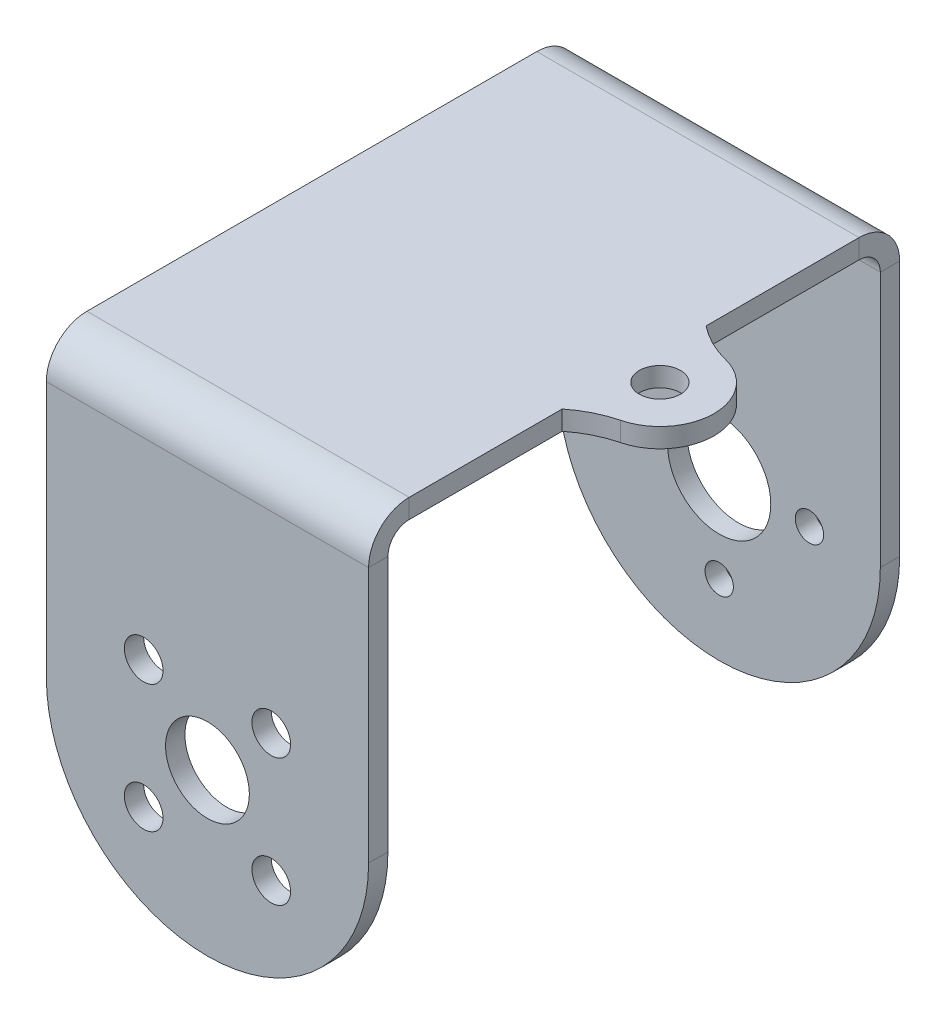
ISO-10303-21;
HEADER;
FILE_DESCRIPTION(('STEP AP214'),'2;1');
FILE_NAME('part.step','',(''),(''),'','','');
FILE_SCHEMA(('AUTOMOTIVE_DESIGN { 1 0 10303 214 1 1 1 1 }'));
ENDSEC;
DATA;
#1=APPLICATION_CONTEXT('core data for automotive mechanical design processes');
#2=APPLICATION_PROTOCOL_DEFINITION('international standard','automotive_design',2000,#1);
#3=PRODUCT_CONTEXT('',#1,'mechanical');
#4=PRODUCT('Part','Part','',(#3));
#5=PRODUCT_RELATED_PRODUCT_CATEGORY('part','',(#4));
#6=PRODUCT_DEFINITION_FORMATION('','',#4);
#7=PRODUCT_DEFINITION_CONTEXT('part definition',#1,'design');
#8=PRODUCT_DEFINITION('design','',#6,#7);
#9=PRODUCT_DEFINITION_SHAPE('','',#8);
#10=(LENGTH_UNIT() NAMED_UNIT(*) SI_UNIT(.MILLI.,.METRE.));
#11=(NAMED_UNIT(*) PLANE_ANGLE_UNIT() SI_UNIT($,.RADIAN.));
#12=(NAMED_UNIT(*) SI_UNIT($,.STERADIAN.) SOLID_ANGLE_UNIT());
#13=UNCERTAINTY_MEASURE_WITH_UNIT(LENGTH_MEASURE(1.E-05),#10,'distance_accuracy_value','');
#14=(GEOMETRIC_REPRESENTATION_CONTEXT(3) GLOBAL_UNCERTAINTY_ASSIGNED_CONTEXT((#13)) GLOBAL_UNIT_ASSIGNED_CONTEXT((#10,
#11,#12)) REPRESENTATION_CONTEXT('',''));
#15=CARTESIAN_POINT('',(0.,0.,0.));
#16=DIRECTION('',(0.,0.,1.));
#17=DIRECTION('',(1.,0.,0.));
#18=AXIS2_PLACEMENT_3D('',#15,#16,#17);
#19=CARTESIAN_POINT('',(12.5,-1.5,19.1));
#20=DIRECTION('',(1.,0.,0.));
#21=DIRECTION('',(0.,0.,-1.));
#22=AXIS2_PLACEMENT_3D('',#19,#20,#21);
#23=PLANE('',#22);
#24=DIRECTION('',(0.,-1.,0.));
#25=VECTOR('',#24,1.);
#26=CARTESIAN_POINT('',(12.5,0.,-5.58170194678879));
#27=LINE('',#26,#25);
#28=CARTESIAN_POINT('',(12.5,0.,-5.58170194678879));
#29=VERTEX_POINT('',#28);
#30=CARTESIAN_POINT('',(12.5,-1.5,-5.58170194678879));
#31=VERTEX_POINT('',#30);
#32=EDGE_CURVE('E224',#29,#31,#27,.T.);
#33=ORIENTED_EDGE('',*,*,#32,.T.);
#34=DIRECTION('',(0.,0.,-1.));
#35=VECTOR('',#34,1.);
#36=CARTESIAN_POINT('',(12.5,-1.5,19.1));
#37=LINE('',#36,#35);
#38=CARTESIAN_POINT('',(12.5,-1.50000000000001,-17.45));
#39=VERTEX_POINT('',#38);
#40=EDGE_CURVE('E433',#31,#39,#37,.T.);
#41=ORIENTED_EDGE('',*,*,#40,.T.);
#42=DIRECTION('',(0.,1.,0.));
#43=VECTOR('',#42,1.);
#44=CARTESIAN_POINT('',(12.5,-1.50000000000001,-17.45));
#45=LINE('',#44,#43);
#46=CARTESIAN_POINT('',(12.5,0.,-17.45));
#47=VERTEX_POINT('',#46);
#48=EDGE_CURVE('E349',#39,#47,#45,.T.);
#49=ORIENTED_EDGE('',*,*,#48,.T.);
#50=DIRECTION('',(0.,0.,-1.));
#51=VECTOR('',#50,1.);
#52=CARTESIAN_POINT('',(12.5,0.,19.1));
#53=LINE('',#52,#51);
#54=EDGE_CURVE('E65',#29,#47,#53,.T.);
#55=ORIENTED_EDGE('',*,*,#54,.F.);
#56=EDGE_LOOP('',(#33,#41,#49,#55));
#57=FACE_BOUND('',#56,.T.);
#58=ADVANCED_FACE('F47',(#57),#23,.T.);
#59=CARTESIAN_POINT('',(0.,-1.5,0.));
#60=DIRECTION('',(0.,1.,0.));
#61=DIRECTION('',(0.,0.,1.));
#62=AXIS2_PLACEMENT_3D('',#59,#60,#61);
#63=PLANE('',#62);
#64=DIRECTION('',(1.,0.,0.));
#65=VECTOR('',#64,1.);
#66=CARTESIAN_POINT('',(12.5,-1.50000000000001,-17.45));
#67=LINE('',#66,#65);
#68=CARTESIAN_POINT('',(-12.5,-1.50000000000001,-17.45));
#69=VERTEX_POINT('',#68);
#70=EDGE_CURVE('E357',#39,#69,#67,.F.);
#71=ORIENTED_EDGE('',*,*,#70,.F.);
#72=ORIENTED_EDGE('',*,*,#40,.F.);
#73=CARTESIAN_POINT('',(17.5,-1.5,-11.8266999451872));
#74=DIRECTION('',(0.,1.,0.));
#75=DIRECTION('',(0.,0.,-1.));
#76=AXIS2_PLACEMENT_3D('',#73,#74,#75);
#77=CIRCLE('',#76,8.);
#78=CARTESIAN_POINT('',(15.5329906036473,-1.5,-4.07228997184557));
#79=VERTEX_POINT('',#78);
#80=EDGE_CURVE('E203',#31,#79,#77,.T.);
#81=ORIENTED_EDGE('',*,*,#80,.T.);
#82=CARTESIAN_POINT('',(14.5,-1.5,-1.30104260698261E-12));
#83=DIRECTION('',(0.,-1.,0.));
#84=DIRECTION('',(0.,0.,-1.));
#85=AXIS2_PLACEMENT_3D('',#82,#83,#84);
#86=CIRCLE('',#85,4.20126352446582);
#87=CARTESIAN_POINT('',(15.5329906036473,-1.5,4.07228997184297));
#88=VERTEX_POINT('',#87);
#89=EDGE_CURVE('E216',#79,#88,#86,.T.);
#90=ORIENTED_EDGE('',*,*,#89,.T.);
#91=CARTESIAN_POINT('',(17.5,-1.5,11.8266999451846));
#92=DIRECTION('',(0.,1.,0.));
#93=DIRECTION('',(0.,0.,-1.));
#94=AXIS2_PLACEMENT_3D('',#91,#92,#93);
#95=CIRCLE('',#94,8.);
#96=CARTESIAN_POINT('',(12.5,-1.5,5.58170194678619));
#97=VERTEX_POINT('',#96);
#98=EDGE_CURVE('E181',#88,#97,#95,.T.);
#99=ORIENTED_EDGE('',*,*,#98,.T.);
#100=CARTESIAN_POINT('',(12.5,-1.5,17.45));
#101=VERTEX_POINT('',#100);
#102=EDGE_CURVE('E434',#101,#97,#37,.T.);
#103=ORIENTED_EDGE('',*,*,#102,.F.);
#104=DIRECTION('',(-1.,0.,0.));
#105=VECTOR('',#104,1.);
#106=CARTESIAN_POINT('',(-12.5,-1.5,17.45));
#107=LINE('',#106,#105);
#108=CARTESIAN_POINT('',(-12.5,-1.5,17.45));
#109=VERTEX_POINT('',#108);
#110=EDGE_CURVE('E415',#109,#101,#107,.F.);
#111=ORIENTED_EDGE('',*,*,#110,.F.);
#112=DIRECTION('',(0.,0.,1.));
#113=VECTOR('',#112,1.);
#114=CARTESIAN_POINT('',(-12.5,-1.5,19.1));
#115=LINE('',#114,#113);
#116=EDGE_CURVE('E429',#69,#109,#115,.T.);
#117=ORIENTED_EDGE('',*,*,#116,.F.);
#118=EDGE_LOOP('',(#71,#72,#81,#90,#99,#103,#111,#117));
#119=FACE_BOUND('',#118,.T.);
#120=CARTESIAN_POINT('',(14.5,-1.5,-1.30104260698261E-12));
#121=DIRECTION('',(0.,-1.,0.));
#122=DIRECTION('',(0.,0.,-1.));
#123=AXIS2_PLACEMENT_3D('',#120,#121,#122);
#124=CIRCLE('',#123,1.6);
#125=CARTESIAN_POINT('',(14.5,-1.5,-1.6000000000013));
#126=VERTEX_POINT('',#125);
#127=EDGE_CURVE('E211',#126,#126,#124,.T.);
#128=ORIENTED_EDGE('',*,*,#127,.F.);
#129=EDGE_LOOP('',(#128));
#130=FACE_BOUND('',#129,.T.);
#131=ADVANCED_FACE('F531',(#119,#130),#63,.F.);
#132=CARTESIAN_POINT('',(0.,0.,0.));
#133=DIRECTION('',(0.,1.,0.));
#134=DIRECTION('',(0.,0.,1.));
#135=AXIS2_PLACEMENT_3D('',#132,#133,#134);
#136=PLANE('',#135);
#137=CARTESIAN_POINT('',(12.5,0.,17.45));
#138=VERTEX_POINT('',#137);
#139=CARTESIAN_POINT('',(12.5,0.,5.58170194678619));
#140=VERTEX_POINT('',#139);
#141=EDGE_CURVE('E197',#138,#140,#53,.T.);
#142=ORIENTED_EDGE('',*,*,#141,.T.);
#143=CARTESIAN_POINT('',(17.5,0.,11.8266999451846));
#144=DIRECTION('',(0.,1.,0.));
#145=DIRECTION('',(0.,0.,-1.));
#146=AXIS2_PLACEMENT_3D('',#143,#144,#145);
#147=CIRCLE('',#146,8.);
#148=CARTESIAN_POINT('',(15.5329906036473,0.,4.07228997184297));
#149=VERTEX_POINT('',#148);
#150=EDGE_CURVE('E179',#149,#140,#147,.T.);
#151=ORIENTED_EDGE('',*,*,#150,.F.);
#152=CARTESIAN_POINT('',(14.5,0.,-1.30104260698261E-12));
#153=DIRECTION('',(0.,-1.,0.));
#154=DIRECTION('',(0.,0.,-1.));
#155=AXIS2_PLACEMENT_3D('',#152,#153,#154);
#156=CIRCLE('',#155,4.20126352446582);
#157=CARTESIAN_POINT('',(15.5329906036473,0.,-4.07228997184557));
#158=VERTEX_POINT('',#157);
#159=EDGE_CURVE('E194',#158,#149,#156,.T.);
#160=ORIENTED_EDGE('',*,*,#159,.F.);
#161=CARTESIAN_POINT('',(17.5,0.,-11.8266999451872));
#162=DIRECTION('',(0.,1.,0.));
#163=DIRECTION('',(0.,0.,-1.));
#164=AXIS2_PLACEMENT_3D('',#161,#162,#163);
#165=CIRCLE('',#164,8.);
#166=EDGE_CURVE('E187',#29,#158,#165,.T.);
#167=ORIENTED_EDGE('',*,*,#166,.F.);
#168=ORIENTED_EDGE('',*,*,#54,.T.);
#169=DIRECTION('',(1.,0.,0.));
#170=VECTOR('',#169,1.);
#171=CARTESIAN_POINT('',(12.5,0.,-17.45));
#172=LINE('',#171,#170);
#173=CARTESIAN_POINT('',(-12.5,0.,-17.45));
#174=VERTEX_POINT('',#173);
#175=EDGE_CURVE('E340',#47,#174,#172,.F.);
#176=ORIENTED_EDGE('',*,*,#175,.T.);
#177=DIRECTION('',(0.,0.,1.));
#178=VECTOR('',#177,1.);
#179=CARTESIAN_POINT('',(-12.5,0.,19.1));
#180=LINE('',#179,#178);
#181=CARTESIAN_POINT('',(-12.5,0.,17.45));
#182=VERTEX_POINT('',#181);
#183=EDGE_CURVE('E425',#174,#182,#180,.T.);
#184=ORIENTED_EDGE('',*,*,#183,.T.);
#185=DIRECTION('',(-1.,0.,0.));
#186=VECTOR('',#185,1.);
#187=CARTESIAN_POINT('',(-12.5,0.,17.45));
#188=LINE('',#187,#186);
#189=EDGE_CURVE('E399',#182,#138,#188,.F.);
#190=ORIENTED_EDGE('',*,*,#189,.T.);
#191=EDGE_LOOP('',(#142,#151,#160,#167,#168,#176,#184,#190));
#192=FACE_BOUND('',#191,.T.);
#193=CARTESIAN_POINT('',(14.5,0.,-1.30104260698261E-12));
#194=DIRECTION('',(0.,-1.,0.));
#195=DIRECTION('',(0.,0.,-1.));
#196=AXIS2_PLACEMENT_3D('',#193,#194,#195);
#197=CIRCLE('',#196,1.6);
#198=CARTESIAN_POINT('',(14.5,0.,-1.6000000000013));
#199=VERTEX_POINT('',#198);
#200=EDGE_CURVE('E219',#199,#199,#197,.T.);
#201=ORIENTED_EDGE('',*,*,#200,.T.);
#202=EDGE_LOOP('',(#201));
#203=FACE_BOUND('',#202,.T.);
#204=ADVANCED_FACE('F191',(#192,#203),#136,.T.);
#205=DIRECTION('',(0.,-1.,0.));
#206=VECTOR('',#205,1.);
#207=CARTESIAN_POINT('',(12.5,0.,5.58170194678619));
#208=LINE('',#207,#206);
#209=EDGE_CURVE('E73',#140,#97,#208,.T.);
#210=ORIENTED_EDGE('',*,*,#209,.F.);
#211=ORIENTED_EDGE('',*,*,#141,.F.);
#212=DIRECTION('',(0.,1.,0.));
#213=VECTOR('',#212,1.);
#214=CARTESIAN_POINT('',(12.5,-1.5,17.45));
#215=LINE('',#214,#213);
#216=EDGE_CURVE('E421',#101,#138,#215,.T.);
#217=ORIENTED_EDGE('',*,*,#216,.F.);
#218=ORIENTED_EDGE('',*,*,#102,.T.);
#219=EDGE_LOOP('',(#210,#211,#217,#218));
#220=FACE_BOUND('',#219,.T.);
#221=ADVANCED_FACE('F543',(#220),#23,.T.);
#222=CARTESIAN_POINT('',(-12.5,-1.5,19.1));
#223=DIRECTION('',(-1.,0.,0.));
#224=DIRECTION('',(0.,0.,1.));
#225=AXIS2_PLACEMENT_3D('',#222,#223,#224);
#226=PLANE('',#225);
#227=DIRECTION('',(0.,1.,0.));
#228=VECTOR('',#227,1.);
#229=CARTESIAN_POINT('',(-12.5,-1.50000000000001,-17.45));
#230=LINE('',#229,#228);
#231=EDGE_CURVE('E363',#69,#174,#230,.T.);
#232=ORIENTED_EDGE('',*,*,#231,.F.);
#233=ORIENTED_EDGE('',*,*,#116,.T.);
#234=DIRECTION('',(0.,1.,0.));
#235=VECTOR('',#234,1.);
#236=CARTESIAN_POINT('',(-12.5,-1.5,17.45));
#237=LINE('',#236,#235);
#238=EDGE_CURVE('E407',#109,#182,#237,.T.);
#239=ORIENTED_EDGE('',*,*,#238,.T.);
#240=ORIENTED_EDGE('',*,*,#183,.F.);
#241=EDGE_LOOP('',(#232,#233,#239,#240));
#242=FACE_BOUND('',#241,.T.);
#243=ADVANCED_FACE('F528',(#242),#226,.T.);
#244=CARTESIAN_POINT('',(12.5,-3.15,17.45));
#245=DIRECTION('',(1.,0.,0.));
#246=DIRECTION('',(0.,0.,-1.));
#247=AXIS2_PLACEMENT_3D('',#244,#245,#246);
#248=PLANE('',#247);
#249=DIRECTION('',(0.,0.,1.));
#250=VECTOR('',#249,1.);
#251=CARTESIAN_POINT('',(12.5,-3.15,19.1));
#252=LINE('',#251,#250);
#253=CARTESIAN_POINT('',(12.5,-3.14999999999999,19.1));
#254=VERTEX_POINT('',#253);
#255=CARTESIAN_POINT('',(12.5,-3.14999999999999,20.6));
#256=VERTEX_POINT('',#255);
#257=EDGE_CURVE('E367',#254,#256,#252,.T.);
#258=ORIENTED_EDGE('',*,*,#257,.F.);
#259=CARTESIAN_POINT('',(12.5,-3.15,17.45));
#260=DIRECTION('',(-1.,0.,0.));
#261=DIRECTION('',(0.,0.,1.));
#262=AXIS2_PLACEMENT_3D('',#259,#260,#261);
#263=CIRCLE('',#262,1.65);
#264=EDGE_CURVE('E411',#101,#254,#263,.F.);
#265=ORIENTED_EDGE('',*,*,#264,.F.);
#266=ORIENTED_EDGE('',*,*,#216,.T.);
#267=CARTESIAN_POINT('',(12.5,-3.15,17.45));
#268=DIRECTION('',(-1.,0.,0.));
#269=DIRECTION('',(0.,0.,1.));
#270=AXIS2_PLACEMENT_3D('',#267,#268,#269);
#271=CIRCLE('',#270,3.15);
#272=EDGE_CURVE('E402',#138,#256,#271,.F.);
#273=ORIENTED_EDGE('',*,*,#272,.T.);
#274=EDGE_LOOP('',(#258,#265,#266,#273));
#275=FACE_BOUND('',#274,.T.);
#276=ADVANCED_FACE('F542',(#275),#248,.T.);
#277=CARTESIAN_POINT('',(-12.5,-3.15,17.45));
#278=DIRECTION('',(1.,0.,0.));
#279=DIRECTION('',(0.,0.,-1.));
#280=AXIS2_PLACEMENT_3D('',#277,#278,#279);
#281=PLANE('',#280);
#282=CARTESIAN_POINT('',(-12.5,-3.15,17.45));
#283=DIRECTION('',(-1.,0.,0.));
#284=DIRECTION('',(0.,0.,1.));
#285=AXIS2_PLACEMENT_3D('',#282,#283,#284);
#286=CIRCLE('',#285,1.65);
#287=CARTESIAN_POINT('',(-12.5,-3.14999999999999,19.1));
#288=VERTEX_POINT('',#287);
#289=EDGE_CURVE('E393',#288,#109,#286,.T.);
#290=ORIENTED_EDGE('',*,*,#289,.F.);
#291=DIRECTION('',(0.,0.,1.));
#292=VECTOR('',#291,1.);
#293=CARTESIAN_POINT('',(-12.5,-3.15,19.1));
#294=LINE('',#293,#292);
#295=CARTESIAN_POINT('',(-12.5,-3.15,20.6));
#296=VERTEX_POINT('',#295);
#297=EDGE_CURVE('E373',#288,#296,#294,.T.);
#298=ORIENTED_EDGE('',*,*,#297,.T.);
#299=CARTESIAN_POINT('',(-12.5,-3.15,17.45));
#300=DIRECTION('',(-1.,0.,0.));
#301=DIRECTION('',(0.,0.,1.));
#302=AXIS2_PLACEMENT_3D('',#299,#300,#301);
#303=CIRCLE('',#302,3.15);
#304=EDGE_CURVE('E403',#296,#182,#303,.T.);
#305=ORIENTED_EDGE('',*,*,#304,.T.);
#306=ORIENTED_EDGE('',*,*,#238,.F.);
#307=EDGE_LOOP('',(#290,#298,#305,#306));
#308=FACE_BOUND('',#307,.T.);
#309=ADVANCED_FACE('F696',(#308),#281,.F.);
#310=CARTESIAN_POINT('',(-12.5,-3.15,17.45));
#311=DIRECTION('',(-1.,0.,0.));
#312=DIRECTION('',(0.,0.,1.));
#313=AXIS2_PLACEMENT_3D('',#310,#311,#312);
#314=CYLINDRICAL_SURFACE('',#313,3.15);
#315=ORIENTED_EDGE('',*,*,#189,.F.);
#316=ORIENTED_EDGE('',*,*,#304,.F.);
#317=DIRECTION('',(1.,0.,0.));
#318=VECTOR('',#317,1.);
#319=CARTESIAN_POINT('',(0.,-3.15,20.6));
#320=LINE('',#319,#318);
#321=EDGE_CURVE('E377',#296,#256,#320,.T.);
#322=ORIENTED_EDGE('',*,*,#321,.T.);
#323=ORIENTED_EDGE('',*,*,#272,.F.);
#324=EDGE_LOOP('',(#315,#316,#322,#323));
#325=FACE_BOUND('',#324,.T.);
#326=ADVANCED_FACE('F892',(#325),#314,.T.);
#327=CARTESIAN_POINT('',(-12.5,-3.15,17.45));
#328=DIRECTION('',(-1.,0.,0.));
#329=DIRECTION('',(0.,0.,1.));
#330=AXIS2_PLACEMENT_3D('',#327,#328,#329);
#331=CYLINDRICAL_SURFACE('',#330,1.65);
#332=ORIENTED_EDGE('',*,*,#110,.T.);
#333=ORIENTED_EDGE('',*,*,#264,.T.);
#334=DIRECTION('',(-1.,0.,0.));
#335=VECTOR('',#334,1.);
#336=CARTESIAN_POINT('',(12.5,-3.15,19.1));
#337=LINE('',#336,#335);
#338=EDGE_CURVE('E370',#254,#288,#337,.T.);
#339=ORIENTED_EDGE('',*,*,#338,.T.);
#340=ORIENTED_EDGE('',*,*,#289,.T.);
#341=EDGE_LOOP('',(#332,#333,#339,#340));
#342=FACE_BOUND('',#341,.T.);
#343=ADVANCED_FACE('F536',(#342),#331,.F.);
#344=CARTESIAN_POINT('',(-12.5,-35.5,20.6000000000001));
#345=DIRECTION('',(1.,0.,0.));
#346=DIRECTION('',(0.,1.,0.));
#347=AXIS2_PLACEMENT_3D('',#344,#345,#346);
#348=PLANE('',#347);
#349=DIRECTION('',(0.,-1.,0.));
#350=VECTOR('',#349,1.);
#351=CARTESIAN_POINT('',(-12.5,-35.5,19.1000000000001));
#352=LINE('',#351,#350);
#353=CARTESIAN_POINT('',(-12.5,-23.,19.1000000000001));
#354=VERTEX_POINT('',#353);
#355=EDGE_CURVE('E384',#288,#354,#352,.T.);
#356=ORIENTED_EDGE('',*,*,#355,.T.);
#357=DIRECTION('',(0.,0.,-1.));
#358=VECTOR('',#357,1.);
#359=CARTESIAN_POINT('',(-12.5,-23.,20.6000000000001));
#360=LINE('',#359,#358);
#361=CARTESIAN_POINT('',(-12.5,-23.,20.6000000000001));
#362=VERTEX_POINT('',#361);
#363=EDGE_CURVE('E458',#354,#362,#360,.F.);
#364=ORIENTED_EDGE('',*,*,#363,.T.);
#365=DIRECTION('',(0.,-1.,0.));
#366=VECTOR('',#365,1.);
#367=CARTESIAN_POINT('',(-12.5,-35.5,20.6000000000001));
#368=LINE('',#367,#366);
#369=EDGE_CURVE('E385',#296,#362,#368,.T.);
#370=ORIENTED_EDGE('',*,*,#369,.F.);
#371=ORIENTED_EDGE('',*,*,#297,.F.);
#372=EDGE_LOOP('',(#356,#364,#370,#371));
#373=FACE_BOUND('',#372,.T.);
#374=ADVANCED_FACE('F879',(#373),#348,.F.);
#375=CARTESIAN_POINT('',(12.5,-1.49999999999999,20.6));
#376=DIRECTION('',(-1.,0.,0.));
#377=DIRECTION('',(0.,0.,1.));
#378=AXIS2_PLACEMENT_3D('',#375,#376,#377);
#379=PLANE('',#378);
#380=DIRECTION('',(0.,1.,0.));
#381=VECTOR('',#380,1.);
#382=CARTESIAN_POINT('',(12.5,-1.49999999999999,20.6));
#383=LINE('',#382,#381);
#384=CARTESIAN_POINT('',(12.5,-23.,20.6000000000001));
#385=VERTEX_POINT('',#384);
#386=EDGE_CURVE('E389',#385,#256,#383,.T.);
#387=ORIENTED_EDGE('',*,*,#386,.F.);
#388=DIRECTION('',(0.,0.,-1.));
#389=VECTOR('',#388,1.);
#390=CARTESIAN_POINT('',(12.5,-23.,20.6000000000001));
#391=LINE('',#390,#389);
#392=CARTESIAN_POINT('',(12.5,-23.,19.1000000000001));
#393=VERTEX_POINT('',#392);
#394=EDGE_CURVE('E437',#385,#393,#391,.T.);
#395=ORIENTED_EDGE('',*,*,#394,.T.);
#396=DIRECTION('',(0.,1.,0.));
#397=VECTOR('',#396,1.);
#398=CARTESIAN_POINT('',(12.5,-1.5,19.1));
#399=LINE('',#398,#397);
#400=EDGE_CURVE('E390',#393,#254,#399,.T.);
#401=ORIENTED_EDGE('',*,*,#400,.T.);
#402=ORIENTED_EDGE('',*,*,#257,.T.);
#403=EDGE_LOOP('',(#387,#395,#401,#402));
#404=FACE_BOUND('',#403,.T.);
#405=ADVANCED_FACE('F871',(#404),#379,.F.);
#406=CARTESIAN_POINT('',(0.,0.,20.6));
#407=DIRECTION('',(0.,0.,-1.));
#408=DIRECTION('',(0.,1.,0.));
#409=AXIS2_PLACEMENT_3D('',#406,#407,#408);
#410=PLANE('',#409);
#411=CARTESIAN_POINT('',(4.94974746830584,-18.0502525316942,20.6));
#412=DIRECTION('',(0.,0.,1.));
#413=DIRECTION('',(1.,0.,0.));
#414=AXIS2_PLACEMENT_3D('',#411,#412,#413);
#415=CIRCLE('',#414,1.5);
#416=CARTESIAN_POINT('',(6.44974746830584,-18.0502525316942,20.6));
#417=VERTEX_POINT('',#416);
#418=EDGE_CURVE('E287',#417,#417,#415,.T.);
#419=ORIENTED_EDGE('',*,*,#418,.F.);
#420=EDGE_LOOP('',(#419));
#421=FACE_BOUND('',#420,.T.);
#422=CARTESIAN_POINT('',(-4.94974746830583,-27.9497474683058,20.6));
#423=DIRECTION('',(0.,0.,1.));
#424=DIRECTION('',(1.,0.,0.));
#425=AXIS2_PLACEMENT_3D('',#422,#423,#424);
#426=CIRCLE('',#425,1.5);
#427=CARTESIAN_POINT('',(-3.44974746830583,-27.9497474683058,20.6));
#428=VERTEX_POINT('',#427);
#429=EDGE_CURVE('E280',#428,#428,#426,.T.);
#430=ORIENTED_EDGE('',*,*,#429,.F.);
#431=EDGE_LOOP('',(#430));
#432=FACE_BOUND('',#431,.T.);
#433=CARTESIAN_POINT('',(4.94974746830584,-27.9497474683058,20.6));
#434=DIRECTION('',(0.,0.,1.));
#435=DIRECTION('',(1.,0.,0.));
#436=AXIS2_PLACEMENT_3D('',#433,#434,#435);
#437=CIRCLE('',#436,1.5);
#438=CARTESIAN_POINT('',(6.44974746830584,-27.9497474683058,20.6));
#439=VERTEX_POINT('',#438);
#440=EDGE_CURVE('E271',#439,#439,#437,.T.);
#441=ORIENTED_EDGE('',*,*,#440,.F.);
#442=EDGE_LOOP('',(#441));
#443=FACE_BOUND('',#442,.T.);
#444=CARTESIAN_POINT('',(0.,-23.,20.6));
#445=DIRECTION('',(0.,0.,1.));
#446=DIRECTION('',(1.,0.,0.));
#447=AXIS2_PLACEMENT_3D('',#444,#445,#446);
#448=CIRCLE('',#447,3.25000000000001);
#449=CARTESIAN_POINT('',(3.25000000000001,-23.,20.6));
#450=VERTEX_POINT('',#449);
#451=EDGE_CURVE('E267',#450,#450,#448,.T.);
#452=ORIENTED_EDGE('',*,*,#451,.F.);
#453=EDGE_LOOP('',(#452));
#454=FACE_BOUND('',#453,.T.);
#455=CARTESIAN_POINT('',(-4.94974746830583,-18.0502525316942,20.6));
#456=DIRECTION('',(0.,0.,1.));
#457=DIRECTION('',(1.,0.,0.));
#458=AXIS2_PLACEMENT_3D('',#455,#456,#457);
#459=CIRCLE('',#458,1.5);
#460=CARTESIAN_POINT('',(-3.44974746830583,-18.0502525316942,20.6));
#461=VERTEX_POINT('',#460);
#462=EDGE_CURVE('E306',#461,#461,#459,.T.);
#463=ORIENTED_EDGE('',*,*,#462,.F.);
#464=EDGE_LOOP('',(#463));
#465=FACE_BOUND('',#464,.T.);
#466=CARTESIAN_POINT('',(0.,-23.,20.6000000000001));
#467=DIRECTION('',(0.,0.,-1.));
#468=DIRECTION('',(0.,1.,0.));
#469=AXIS2_PLACEMENT_3D('',#466,#467,#468);
#470=CIRCLE('',#469,12.5);
#471=CARTESIAN_POINT('',(0.,-35.5,20.6000000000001));
#472=VERTEX_POINT('',#471);
#473=EDGE_CURVE('E452',#362,#472,#470,.F.);
#474=ORIENTED_EDGE('',*,*,#473,.T.);
#475=CARTESIAN_POINT('',(0.,-23.,20.6000000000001));
#476=DIRECTION('',(0.,0.,-1.));
#477=DIRECTION('',(0.,1.,0.));
#478=AXIS2_PLACEMENT_3D('',#475,#476,#477);
#479=CIRCLE('',#478,12.5);
#480=EDGE_CURVE('E455',#472,#385,#479,.F.);
#481=ORIENTED_EDGE('',*,*,#480,.T.);
#482=ORIENTED_EDGE('',*,*,#386,.T.);
#483=ORIENTED_EDGE('',*,*,#321,.F.);
#484=ORIENTED_EDGE('',*,*,#369,.T.);
#485=EDGE_LOOP('',(#474,#481,#482,#483,#484));
#486=FACE_BOUND('',#485,.T.);
#487=ADVANCED_FACE('F863',(#421,#432,#443,#454,#465,#486),#410,.F.);
#488=CARTESIAN_POINT('',(0.,0.,19.1));
#489=DIRECTION('',(0.,0.,-1.));
#490=DIRECTION('',(0.,1.,0.));
#491=AXIS2_PLACEMENT_3D('',#488,#489,#490);
#492=PLANE('',#491);
#493=CARTESIAN_POINT('',(4.94974746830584,-18.0502525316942,19.1000000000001));
#494=DIRECTION('',(0.,0.,-1.));
#495=DIRECTION('',(0.,1.,0.));
#496=AXIS2_PLACEMENT_3D('',#493,#494,#495);
#497=CIRCLE('',#496,1.5);
#498=CARTESIAN_POINT('',(4.94974746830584,-16.5502525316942,19.1000000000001));
#499=VERTEX_POINT('',#498);
#500=EDGE_CURVE('E291',#499,#499,#497,.F.);
#501=ORIENTED_EDGE('',*,*,#500,.T.);
#502=EDGE_LOOP('',(#501));
#503=FACE_BOUND('',#502,.T.);
#504=CARTESIAN_POINT('',(-4.94974746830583,-27.9497474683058,19.1000000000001));
#505=DIRECTION('',(0.,0.,-1.));
#506=DIRECTION('',(0.,1.,0.));
#507=AXIS2_PLACEMENT_3D('',#504,#505,#506);
#508=CIRCLE('',#507,1.5);
#509=CARTESIAN_POINT('',(-4.94974746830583,-26.4497474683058,19.1000000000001));
#510=VERTEX_POINT('',#509);
#511=EDGE_CURVE('E292',#510,#510,#508,.F.);
#512=ORIENTED_EDGE('',*,*,#511,.T.);
#513=EDGE_LOOP('',(#512));
#514=FACE_BOUND('',#513,.T.);
#515=CARTESIAN_POINT('',(4.94974746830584,-27.9497474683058,19.1000000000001));
#516=DIRECTION('',(0.,0.,-1.));
#517=DIRECTION('',(0.,1.,0.));
#518=AXIS2_PLACEMENT_3D('',#515,#516,#517);
#519=CIRCLE('',#518,1.5);
#520=CARTESIAN_POINT('',(4.94974746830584,-26.4497474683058,19.1000000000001));
#521=VERTEX_POINT('',#520);
#522=EDGE_CURVE('E275',#521,#521,#519,.F.);
#523=ORIENTED_EDGE('',*,*,#522,.T.);
#524=EDGE_LOOP('',(#523));
#525=FACE_BOUND('',#524,.T.);
#526=CARTESIAN_POINT('',(0.,-23.,19.1000000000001));
#527=DIRECTION('',(0.,0.,-1.));
#528=DIRECTION('',(0.,1.,0.));
#529=AXIS2_PLACEMENT_3D('',#526,#527,#528);
#530=CIRCLE('',#529,3.25000000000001);
#531=CARTESIAN_POINT('',(0.,-19.75,19.1000000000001));
#532=VERTEX_POINT('',#531);
#533=EDGE_CURVE('E276',#532,#532,#530,.F.);
#534=ORIENTED_EDGE('',*,*,#533,.T.);
#535=EDGE_LOOP('',(#534));
#536=FACE_BOUND('',#535,.T.);
#537=CARTESIAN_POINT('',(-4.94974746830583,-18.0502525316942,19.1000000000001));
#538=DIRECTION('',(0.,0.,-1.));
#539=DIRECTION('',(0.,1.,0.));
#540=AXIS2_PLACEMENT_3D('',#537,#538,#539);
#541=CIRCLE('',#540,1.5);
#542=CARTESIAN_POINT('',(-4.94974746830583,-16.5502525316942,19.1000000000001));
#543=VERTEX_POINT('',#542);
#544=EDGE_CURVE('E296',#543,#543,#541,.F.);
#545=ORIENTED_EDGE('',*,*,#544,.T.);
#546=EDGE_LOOP('',(#545));
#547=FACE_BOUND('',#546,.T.);
#548=ORIENTED_EDGE('',*,*,#400,.F.);
#549=CARTESIAN_POINT('',(0.,-23.,19.1000000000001));
#550=DIRECTION('',(0.,0.,-1.));
#551=DIRECTION('',(0.,1.,0.));
#552=AXIS2_PLACEMENT_3D('',#549,#550,#551);
#553=CIRCLE('',#552,12.5);
#554=CARTESIAN_POINT('',(0.,-35.5,19.1000000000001));
#555=VERTEX_POINT('',#554);
#556=EDGE_CURVE('E449',#393,#555,#553,.T.);
#557=ORIENTED_EDGE('',*,*,#556,.T.);
#558=CARTESIAN_POINT('',(0.,-23.,19.1000000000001));
#559=DIRECTION('',(0.,0.,-1.));
#560=DIRECTION('',(0.,1.,0.));
#561=AXIS2_PLACEMENT_3D('',#558,#559,#560);
#562=CIRCLE('',#561,12.5);
#563=EDGE_CURVE('E446',#555,#354,#562,.T.);
#564=ORIENTED_EDGE('',*,*,#563,.T.);
#565=ORIENTED_EDGE('',*,*,#355,.F.);
#566=ORIENTED_EDGE('',*,*,#338,.F.);
#567=EDGE_LOOP('',(#548,#557,#564,#565,#566));
#568=FACE_BOUND('',#567,.T.);
#569=ADVANCED_FACE('F856',(#503,#514,#525,#536,#547,#568),#492,.T.);
#570=CARTESIAN_POINT('',(-12.5,-3.15000000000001,-17.45));
#571=DIRECTION('',(-1.,0.,0.));
#572=DIRECTION('',(0.,0.,1.));
#573=AXIS2_PLACEMENT_3D('',#570,#571,#572);
#574=PLANE('',#573);
#575=DIRECTION('',(0.,0.,-1.));
#576=VECTOR('',#575,1.);
#577=CARTESIAN_POINT('',(-12.5,-3.15,-19.1));
#578=LINE('',#577,#576);
#579=CARTESIAN_POINT('',(-12.5,-3.15,-19.1));
#580=VERTEX_POINT('',#579);
#581=CARTESIAN_POINT('',(-12.5,-3.15,-20.6));
#582=VERTEX_POINT('',#581);
#583=EDGE_CURVE('E310',#580,#582,#578,.T.);
#584=ORIENTED_EDGE('',*,*,#583,.F.);
#585=CARTESIAN_POINT('',(-12.5,-3.15000000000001,-17.45));
#586=DIRECTION('',(1.,0.,0.));
#587=DIRECTION('',(0.,0.,-1.));
#588=AXIS2_PLACEMENT_3D('',#585,#586,#587);
#589=CIRCLE('',#588,1.65);
#590=EDGE_CURVE('E353',#69,#580,#589,.F.);
#591=ORIENTED_EDGE('',*,*,#590,.F.);
#592=ORIENTED_EDGE('',*,*,#231,.T.);
#593=CARTESIAN_POINT('',(-12.5,-3.15000000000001,-17.45));
#594=DIRECTION('',(1.,0.,0.));
#595=DIRECTION('',(0.,0.,-1.));
#596=AXIS2_PLACEMENT_3D('',#593,#594,#595);
#597=CIRCLE('',#596,3.15);
#598=EDGE_CURVE('E344',#174,#582,#597,.F.);
#599=ORIENTED_EDGE('',*,*,#598,.T.);
#600=EDGE_LOOP('',(#584,#591,#592,#599));
#601=FACE_BOUND('',#600,.T.);
#602=ADVANCED_FACE('F517',(#601),#574,.T.);
#603=CARTESIAN_POINT('',(12.5,-3.15000000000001,-17.45));
#604=DIRECTION('',(-1.,0.,0.));
#605=DIRECTION('',(0.,0.,1.));
#606=AXIS2_PLACEMENT_3D('',#603,#604,#605);
#607=PLANE('',#606);
#608=CARTESIAN_POINT('',(12.5,-3.15000000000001,-17.45));
#609=DIRECTION('',(1.,0.,0.));
#610=DIRECTION('',(0.,0.,-1.));
#611=AXIS2_PLACEMENT_3D('',#608,#609,#610);
#612=CIRCLE('',#611,1.65);
#613=CARTESIAN_POINT('',(12.5,-3.15,-19.1));
#614=VERTEX_POINT('',#613);
#615=EDGE_CURVE('E334',#614,#39,#612,.T.);
#616=ORIENTED_EDGE('',*,*,#615,.F.);
#617=DIRECTION('',(0.,0.,-1.));
#618=VECTOR('',#617,1.);
#619=CARTESIAN_POINT('',(12.5,-3.15,-19.1));
#620=LINE('',#619,#618);
#621=CARTESIAN_POINT('',(12.5,-3.14999999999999,-20.6));
#622=VERTEX_POINT('',#621);
#623=EDGE_CURVE('E314',#614,#622,#620,.T.);
#624=ORIENTED_EDGE('',*,*,#623,.T.);
#625=CARTESIAN_POINT('',(12.5,-3.15000000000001,-17.45));
#626=DIRECTION('',(1.,0.,0.));
#627=DIRECTION('',(0.,0.,-1.));
#628=AXIS2_PLACEMENT_3D('',#625,#626,#627);
#629=CIRCLE('',#628,3.15);
#630=EDGE_CURVE('E345',#622,#47,#629,.T.);
#631=ORIENTED_EDGE('',*,*,#630,.T.);
#632=ORIENTED_EDGE('',*,*,#48,.F.);
#633=EDGE_LOOP('',(#616,#624,#631,#632));
#634=FACE_BOUND('',#633,.T.);
#635=ADVANCED_FACE('F507',(#634),#607,.F.);
#636=CARTESIAN_POINT('',(12.5,-3.15000000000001,-17.45));
#637=DIRECTION('',(1.,0.,0.));
#638=DIRECTION('',(0.,0.,-1.));
#639=AXIS2_PLACEMENT_3D('',#636,#637,#638);
#640=CYLINDRICAL_SURFACE('',#639,3.15);
#641=ORIENTED_EDGE('',*,*,#175,.F.);
#642=ORIENTED_EDGE('',*,*,#630,.F.);
#643=DIRECTION('',(-1.,0.,0.));
#644=VECTOR('',#643,1.);
#645=CARTESIAN_POINT('',(0.,-3.14999999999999,-20.6));
#646=LINE('',#645,#644);
#647=EDGE_CURVE('E318',#622,#582,#646,.T.);
#648=ORIENTED_EDGE('',*,*,#647,.T.);
#649=ORIENTED_EDGE('',*,*,#598,.F.);
#650=EDGE_LOOP('',(#641,#642,#648,#649));
#651=FACE_BOUND('',#650,.T.);
#652=ADVANCED_FACE('F514',(#651),#640,.T.);
#653=CARTESIAN_POINT('',(12.5,-3.15000000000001,-17.45));
#654=DIRECTION('',(1.,0.,0.));
#655=DIRECTION('',(0.,0.,-1.));
#656=AXIS2_PLACEMENT_3D('',#653,#654,#655);
#657=CYLINDRICAL_SURFACE('',#656,1.65);
#658=ORIENTED_EDGE('',*,*,#70,.T.);
#659=ORIENTED_EDGE('',*,*,#590,.T.);
#660=DIRECTION('',(1.,0.,0.));
#661=VECTOR('',#660,1.);
#662=CARTESIAN_POINT('',(-12.5,-3.15,-19.1));
#663=LINE('',#662,#661);
#664=EDGE_CURVE('E311',#580,#614,#663,.T.);
#665=ORIENTED_EDGE('',*,*,#664,.T.);
#666=ORIENTED_EDGE('',*,*,#615,.T.);
#667=EDGE_LOOP('',(#658,#659,#665,#666));
#668=FACE_BOUND('',#667,.T.);
#669=ADVANCED_FACE('F523',(#668),#657,.F.);
#670=CARTESIAN_POINT('',(12.5,-35.5,-20.6000000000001));
#671=DIRECTION('',(-1.,0.,0.));
#672=DIRECTION('',(0.,0.,1.));
#673=AXIS2_PLACEMENT_3D('',#670,#671,#672);
#674=PLANE('',#673);
#675=DIRECTION('',(0.,-1.,0.));
#676=VECTOR('',#675,1.);
#677=CARTESIAN_POINT('',(12.5,-35.5,-19.1000000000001));
#678=LINE('',#677,#676);
#679=CARTESIAN_POINT('',(12.5,-23.,-19.1000000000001));
#680=VERTEX_POINT('',#679);
#681=EDGE_CURVE('E325',#614,#680,#678,.T.);
#682=ORIENTED_EDGE('',*,*,#681,.T.);
#683=DIRECTION('',(0.,0.,1.));
#684=VECTOR('',#683,1.);
#685=CARTESIAN_POINT('',(12.5,-23.,-20.6000000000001));
#686=LINE('',#685,#684);
#687=CARTESIAN_POINT('',(12.5,-23.,-20.6000000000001));
#688=VERTEX_POINT('',#687);
#689=EDGE_CURVE('E11',#680,#688,#686,.F.);
#690=ORIENTED_EDGE('',*,*,#689,.T.);
#691=DIRECTION('',(0.,-1.,0.));
#692=VECTOR('',#691,1.);
#693=CARTESIAN_POINT('',(12.5,-35.5,-20.6000000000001));
#694=LINE('',#693,#692);
#695=EDGE_CURVE('E326',#622,#688,#694,.T.);
#696=ORIENTED_EDGE('',*,*,#695,.F.);
#697=ORIENTED_EDGE('',*,*,#623,.F.);
#698=EDGE_LOOP('',(#682,#690,#696,#697));
#699=FACE_BOUND('',#698,.T.);
#700=ADVANCED_FACE('F502',(#699),#674,.F.);
#701=CARTESIAN_POINT('',(-12.5,-1.49999999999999,-20.6));
#702=DIRECTION('',(1.,0.,0.));
#703=DIRECTION('',(0.,0.,-1.));
#704=AXIS2_PLACEMENT_3D('',#701,#702,#703);
#705=PLANE('',#704);
#706=DIRECTION('',(0.,1.,0.));
#707=VECTOR('',#706,1.);
#708=CARTESIAN_POINT('',(-12.5,-1.49999999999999,-20.6));
#709=LINE('',#708,#707);
#710=CARTESIAN_POINT('',(-12.5,-23.,-20.6000000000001));
#711=VERTEX_POINT('',#710);
#712=EDGE_CURVE('E330',#711,#582,#709,.T.);
#713=ORIENTED_EDGE('',*,*,#712,.F.);
#714=DIRECTION('',(0.,0.,1.));
#715=VECTOR('',#714,1.);
#716=CARTESIAN_POINT('',(-12.5,-23.,-20.6000000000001));
#717=LINE('',#716,#715);
#718=CARTESIAN_POINT('',(-12.5,-23.,-19.1000000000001));
#719=VERTEX_POINT('',#718);
#720=EDGE_CURVE('E461',#711,#719,#717,.T.);
#721=ORIENTED_EDGE('',*,*,#720,.T.);
#722=DIRECTION('',(0.,1.,0.));
#723=VECTOR('',#722,1.);
#724=CARTESIAN_POINT('',(-12.5,-1.5,-19.1));
#725=LINE('',#724,#723);
#726=EDGE_CURVE('E331',#719,#580,#725,.T.);
#727=ORIENTED_EDGE('',*,*,#726,.T.);
#728=ORIENTED_EDGE('',*,*,#583,.T.);
#729=EDGE_LOOP('',(#713,#721,#727,#728));
#730=FACE_BOUND('',#729,.T.);
#731=ADVANCED_FACE('F521',(#730),#705,.F.);
#732=CARTESIAN_POINT('',(0.,0.,-20.6));
#733=DIRECTION('',(0.,0.,1.));
#734=DIRECTION('',(0.,-1.,0.));
#735=AXIS2_PLACEMENT_3D('',#732,#733,#734);
#736=PLANE('',#735);
#737=CARTESIAN_POINT('',(0.,-29.9999999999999,-20.6000000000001));
#738=DIRECTION('',(0.,0.,-1.));
#739=DIRECTION('',(0.,1.,0.));
#740=AXIS2_PLACEMENT_3D('',#737,#738,#739);
#741=CIRCLE('',#740,1.1);
#742=CARTESIAN_POINT('',(0.,-28.8999999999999,-20.6000000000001));
#743=VERTEX_POINT('',#742);
#744=EDGE_CURVE('E252',#743,#743,#741,.T.);
#745=ORIENTED_EDGE('',*,*,#744,.F.);
#746=EDGE_LOOP('',(#745));
#747=FACE_BOUND('',#746,.T.);
#748=CARTESIAN_POINT('',(-6.99999999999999,-22.9999999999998,-20.6000000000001));
#749=DIRECTION('',(0.,0.,-1.));
#750=DIRECTION('',(0.,1.,0.));
#751=AXIS2_PLACEMENT_3D('',#748,#749,#750);
#752=CIRCLE('',#751,1.1);
#753=CARTESIAN_POINT('',(-6.99999999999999,-21.8999999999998,-20.6000000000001));
#754=VERTEX_POINT('',#753);
#755=EDGE_CURVE('E233',#754,#754,#752,.T.);
#756=ORIENTED_EDGE('',*,*,#755,.F.);
#757=EDGE_LOOP('',(#756));
#758=FACE_BOUND('',#757,.T.);
#759=CARTESIAN_POINT('',(7.,-22.9999999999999,-20.6000000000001));
#760=DIRECTION('',(0.,0.,-1.));
#761=DIRECTION('',(0.,1.,0.));
#762=AXIS2_PLACEMENT_3D('',#759,#760,#761);
#763=CIRCLE('',#762,1.1);
#764=CARTESIAN_POINT('',(7.,-21.8999999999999,-20.6000000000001));
#765=VERTEX_POINT('',#764);
#766=EDGE_CURVE('E234',#765,#765,#763,.T.);
#767=ORIENTED_EDGE('',*,*,#766,.F.);
#768=EDGE_LOOP('',(#767));
#769=FACE_BOUND('',#768,.T.);
#770=CARTESIAN_POINT('',(0.,-15.9999999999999,-20.6000000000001));
#771=DIRECTION('',(0.,0.,-1.));
#772=DIRECTION('',(0.,1.,0.));
#773=AXIS2_PLACEMENT_3D('',#770,#771,#772);
#774=CIRCLE('',#773,1.1);
#775=CARTESIAN_POINT('',(0.,-14.8999999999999,-20.6000000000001));
#776=VERTEX_POINT('',#775);
#777=EDGE_CURVE('E242',#776,#776,#774,.T.);
#778=ORIENTED_EDGE('',*,*,#777,.F.);
#779=EDGE_LOOP('',(#778));
#780=FACE_BOUND('',#779,.T.);
#781=CARTESIAN_POINT('',(0.,-22.9999999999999,-20.6000000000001));
#782=DIRECTION('',(0.,0.,-1.));
#783=DIRECTION('',(0.,1.,0.));
#784=AXIS2_PLACEMENT_3D('',#781,#782,#783);
#785=CIRCLE('',#784,3.99999999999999);
#786=CARTESIAN_POINT('',(0.,-18.9999999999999,-20.6000000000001));
#787=VERTEX_POINT('',#786);
#788=EDGE_CURVE('E263',#787,#787,#785,.T.);
#789=ORIENTED_EDGE('',*,*,#788,.F.);
#790=EDGE_LOOP('',(#789));
#791=FACE_BOUND('',#790,.T.);
#792=CARTESIAN_POINT('',(0.,-23.,-20.6000000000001));
#793=DIRECTION('',(0.,0.,1.));
#794=DIRECTION('',(0.,-1.,0.));
#795=AXIS2_PLACEMENT_3D('',#792,#793,#794);
#796=CIRCLE('',#795,12.5);
#797=CARTESIAN_POINT('',(0.,-35.5,-20.6000000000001));
#798=VERTEX_POINT('',#797);
#799=EDGE_CURVE('E471',#688,#798,#796,.F.);
#800=ORIENTED_EDGE('',*,*,#799,.T.);
#801=CARTESIAN_POINT('',(0.,-23.,-20.6000000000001));
#802=DIRECTION('',(0.,0.,1.));
#803=DIRECTION('',(0.,-1.,0.));
#804=AXIS2_PLACEMENT_3D('',#801,#802,#803);
#805=CIRCLE('',#804,12.5);
#806=EDGE_CURVE('E57',#798,#711,#805,.F.);
#807=ORIENTED_EDGE('',*,*,#806,.T.);
#808=ORIENTED_EDGE('',*,*,#712,.T.);
#809=ORIENTED_EDGE('',*,*,#647,.F.);
#810=ORIENTED_EDGE('',*,*,#695,.T.);
#811=EDGE_LOOP('',(#800,#807,#808,#809,#810));
#812=FACE_BOUND('',#811,.T.);
#813=ADVANCED_FACE('F510',(#747,#758,#769,#780,#791,#812),#736,.F.);
#814=CARTESIAN_POINT('',(0.,0.,-19.1));
#815=DIRECTION('',(0.,0.,1.));
#816=DIRECTION('',(0.,-1.,0.));
#817=AXIS2_PLACEMENT_3D('',#814,#815,#816);
#818=PLANE('',#817);
#819=CARTESIAN_POINT('',(0.,-29.9999999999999,-19.1000000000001));
#820=DIRECTION('',(0.,0.,1.));
#821=DIRECTION('',(0.,-1.,0.));
#822=AXIS2_PLACEMENT_3D('',#819,#820,#821);
#823=CIRCLE('',#822,1.1);
#824=CARTESIAN_POINT('',(0.,-31.0999999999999,-19.1000000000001));
#825=VERTEX_POINT('',#824);
#826=EDGE_CURVE('E247',#825,#825,#823,.F.);
#827=ORIENTED_EDGE('',*,*,#826,.T.);
#828=EDGE_LOOP('',(#827));
#829=FACE_BOUND('',#828,.T.);
#830=CARTESIAN_POINT('',(-6.99999999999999,-22.9999999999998,-19.1000000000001));
#831=DIRECTION('',(0.,0.,1.));
#832=DIRECTION('',(0.,-1.,0.));
#833=AXIS2_PLACEMENT_3D('',#830,#831,#832);
#834=CIRCLE('',#833,1.1);
#835=CARTESIAN_POINT('',(-6.99999999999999,-24.0999999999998,-19.1000000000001));
#836=VERTEX_POINT('',#835);
#837=EDGE_CURVE('E256',#836,#836,#834,.F.);
#838=ORIENTED_EDGE('',*,*,#837,.T.);
#839=EDGE_LOOP('',(#838));
#840=FACE_BOUND('',#839,.T.);
#841=CARTESIAN_POINT('',(7.,-22.9999999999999,-19.1000000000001));
#842=DIRECTION('',(0.,0.,1.));
#843=DIRECTION('',(0.,-1.,0.));
#844=AXIS2_PLACEMENT_3D('',#841,#842,#843);
#845=CIRCLE('',#844,1.1);
#846=CARTESIAN_POINT('',(7.,-24.0999999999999,-19.1000000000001));
#847=VERTEX_POINT('',#846);
#848=EDGE_CURVE('E229',#847,#847,#845,.F.);
#849=ORIENTED_EDGE('',*,*,#848,.T.);
#850=EDGE_LOOP('',(#849));
#851=FACE_BOUND('',#850,.T.);
#852=CARTESIAN_POINT('',(0.,-15.9999999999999,-19.1000000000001));
#853=DIRECTION('',(0.,0.,1.));
#854=DIRECTION('',(0.,-1.,0.));
#855=AXIS2_PLACEMENT_3D('',#852,#853,#854);
#856=CIRCLE('',#855,1.1);
#857=CARTESIAN_POINT('',(0.,-17.0999999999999,-19.1000000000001));
#858=VERTEX_POINT('',#857);
#859=EDGE_CURVE('E238',#858,#858,#856,.F.);
#860=ORIENTED_EDGE('',*,*,#859,.T.);
#861=EDGE_LOOP('',(#860));
#862=FACE_BOUND('',#861,.T.);
#863=CARTESIAN_POINT('',(0.,-22.9999999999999,-19.1000000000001));
#864=DIRECTION('',(0.,0.,1.));
#865=DIRECTION('',(0.,-1.,0.));
#866=AXIS2_PLACEMENT_3D('',#863,#864,#865);
#867=CIRCLE('',#866,3.99999999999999);
#868=CARTESIAN_POINT('',(0.,-26.9999999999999,-19.1000000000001));
#869=VERTEX_POINT('',#868);
#870=EDGE_CURVE('E251',#869,#869,#867,.F.);
#871=ORIENTED_EDGE('',*,*,#870,.T.);
#872=EDGE_LOOP('',(#871));
#873=FACE_BOUND('',#872,.T.);
#874=ORIENTED_EDGE('',*,*,#726,.F.);
#875=CARTESIAN_POINT('',(0.,-23.,-19.1000000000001));
#876=DIRECTION('',(0.,0.,1.));
#877=DIRECTION('',(0.,-1.,0.));
#878=AXIS2_PLACEMENT_3D('',#875,#876,#877);
#879=CIRCLE('',#878,12.5);
#880=CARTESIAN_POINT('',(0.,-35.5,-19.1000000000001));
#881=VERTEX_POINT('',#880);
#882=EDGE_CURVE('E468',#719,#881,#879,.T.);
#883=ORIENTED_EDGE('',*,*,#882,.T.);
#884=CARTESIAN_POINT('',(0.,-23.,-19.1000000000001));
#885=DIRECTION('',(0.,0.,1.));
#886=DIRECTION('',(0.,-1.,0.));
#887=AXIS2_PLACEMENT_3D('',#884,#885,#886);
#888=CIRCLE('',#887,12.5);
#889=EDGE_CURVE('E465',#881,#680,#888,.T.);
#890=ORIENTED_EDGE('',*,*,#889,.T.);
#891=ORIENTED_EDGE('',*,*,#681,.F.);
#892=ORIENTED_EDGE('',*,*,#664,.F.);
#893=EDGE_LOOP('',(#874,#883,#890,#891,#892));
#894=FACE_BOUND('',#893,.T.);
#895=ADVANCED_FACE('F498',(#829,#840,#851,#862,#873,#894),#818,.T.);
#896=CARTESIAN_POINT('',(-4.94974746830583,-18.0502525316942,-20.6010000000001));
#897=DIRECTION('',(0.,0.,1.));
#898=DIRECTION('',(1.,0.,0.));
#899=AXIS2_PLACEMENT_3D('',#896,#897,#898);
#900=CYLINDRICAL_SURFACE('',#899,1.5);
#901=ORIENTED_EDGE('',*,*,#544,.F.);
#902=EDGE_LOOP('',(#901));
#903=FACE_BOUND('',#902,.T.);
#904=ORIENTED_EDGE('',*,*,#462,.T.);
#905=EDGE_LOOP('',(#904));
#906=FACE_BOUND('',#905,.T.);
#907=ADVANCED_FACE('F797',(#903,#906),#900,.F.);
#908=CARTESIAN_POINT('',(0.,-23.,-20.6010000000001));
#909=DIRECTION('',(0.,0.,1.));
#910=DIRECTION('',(1.,0.,0.));
#911=AXIS2_PLACEMENT_3D('',#908,#909,#910);
#912=CYLINDRICAL_SURFACE('',#911,3.25000000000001);
#913=ORIENTED_EDGE('',*,*,#533,.F.);
#914=EDGE_LOOP('',(#913));
#915=FACE_BOUND('',#914,.T.);
#916=ORIENTED_EDGE('',*,*,#451,.T.);
#917=EDGE_LOOP('',(#916));
#918=FACE_BOUND('',#917,.T.);
#919=ADVANCED_FACE('F789',(#915,#918),#912,.F.);
#920=CARTESIAN_POINT('',(4.94974746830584,-27.9497474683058,-20.6010000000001));
#921=DIRECTION('',(0.,0.,1.));
#922=DIRECTION('',(1.,0.,0.));
#923=AXIS2_PLACEMENT_3D('',#920,#921,#922);
#924=CYLINDRICAL_SURFACE('',#923,1.5);
#925=ORIENTED_EDGE('',*,*,#522,.F.);
#926=EDGE_LOOP('',(#925));
#927=FACE_BOUND('',#926,.T.);
#928=ORIENTED_EDGE('',*,*,#440,.T.);
#929=EDGE_LOOP('',(#928));
#930=FACE_BOUND('',#929,.T.);
#931=ADVANCED_FACE('F781',(#927,#930),#924,.F.);
#932=CARTESIAN_POINT('',(-4.94974746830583,-27.9497474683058,-20.6010000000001));
#933=DIRECTION('',(0.,0.,1.));
#934=DIRECTION('',(1.,0.,0.));
#935=AXIS2_PLACEMENT_3D('',#932,#933,#934);
#936=CYLINDRICAL_SURFACE('',#935,1.5);
#937=ORIENTED_EDGE('',*,*,#511,.F.);
#938=EDGE_LOOP('',(#937));
#939=FACE_BOUND('',#938,.T.);
#940=ORIENTED_EDGE('',*,*,#429,.T.);
#941=EDGE_LOOP('',(#940));
#942=FACE_BOUND('',#941,.T.);
#943=ADVANCED_FACE('F773',(#939,#942),#936,.F.);
#944=CARTESIAN_POINT('',(4.94974746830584,-18.0502525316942,-20.6010000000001));
#945=DIRECTION('',(0.,0.,1.));
#946=DIRECTION('',(1.,0.,0.));
#947=AXIS2_PLACEMENT_3D('',#944,#945,#946);
#948=CYLINDRICAL_SURFACE('',#947,1.5);
#949=ORIENTED_EDGE('',*,*,#500,.F.);
#950=EDGE_LOOP('',(#949));
#951=FACE_BOUND('',#950,.T.);
#952=ORIENTED_EDGE('',*,*,#418,.T.);
#953=EDGE_LOOP('',(#952));
#954=FACE_BOUND('',#953,.T.);
#955=ADVANCED_FACE('F765',(#951,#954),#948,.F.);
#956=CARTESIAN_POINT('',(0.,-23.,20.6010000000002));
#957=DIRECTION('',(0.,0.,-1.));
#958=DIRECTION('',(0.,1.,0.));
#959=AXIS2_PLACEMENT_3D('',#956,#957,#958);
#960=CYLINDRICAL_SURFACE('',#959,3.99999999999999);
#961=ORIENTED_EDGE('',*,*,#870,.F.);
#962=EDGE_LOOP('',(#961));
#963=FACE_BOUND('',#962,.T.);
#964=ORIENTED_EDGE('',*,*,#788,.T.);
#965=EDGE_LOOP('',(#964));
#966=FACE_BOUND('',#965,.T.);
#967=ADVANCED_FACE('F757',(#963,#966),#960,.F.);
#968=CARTESIAN_POINT('',(0.,-16.,20.6010000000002));
#969=DIRECTION('',(0.,0.,-1.));
#970=DIRECTION('',(0.,1.,0.));
#971=AXIS2_PLACEMENT_3D('',#968,#969,#970);
#972=CYLINDRICAL_SURFACE('',#971,1.1);
#973=ORIENTED_EDGE('',*,*,#859,.F.);
#974=EDGE_LOOP('',(#973));
#975=FACE_BOUND('',#974,.T.);
#976=ORIENTED_EDGE('',*,*,#777,.T.);
#977=EDGE_LOOP('',(#976));
#978=FACE_BOUND('',#977,.T.);
#979=ADVANCED_FACE('F749',(#975,#978),#972,.F.);
#980=CARTESIAN_POINT('',(7.,-23.,20.6010000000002));
#981=DIRECTION('',(0.,0.,-1.));
#982=DIRECTION('',(0.,1.,0.));
#983=AXIS2_PLACEMENT_3D('',#980,#981,#982);
#984=CYLINDRICAL_SURFACE('',#983,1.1);
#985=ORIENTED_EDGE('',*,*,#848,.F.);
#986=EDGE_LOOP('',(#985));
#987=FACE_BOUND('',#986,.T.);
#988=ORIENTED_EDGE('',*,*,#766,.T.);
#989=EDGE_LOOP('',(#988));
#990=FACE_BOUND('',#989,.T.);
#991=ADVANCED_FACE('F741',(#987,#990),#984,.F.);
#992=CARTESIAN_POINT('',(-6.99999999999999,-23.,20.6010000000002));
#993=DIRECTION('',(0.,0.,-1.));
#994=DIRECTION('',(0.,1.,0.));
#995=AXIS2_PLACEMENT_3D('',#992,#993,#994);
#996=CYLINDRICAL_SURFACE('',#995,1.1);
#997=ORIENTED_EDGE('',*,*,#837,.F.);
#998=EDGE_LOOP('',(#997));
#999=FACE_BOUND('',#998,.T.);
#1000=ORIENTED_EDGE('',*,*,#755,.T.);
#1001=EDGE_LOOP('',(#1000));
#1002=FACE_BOUND('',#1001,.T.);
#1003=ADVANCED_FACE('F732',(#999,#1002),#996,.F.);
#1004=CARTESIAN_POINT('',(0.,-30.,20.6010000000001));
#1005=DIRECTION('',(0.,0.,-1.));
#1006=DIRECTION('',(0.,1.,0.));
#1007=AXIS2_PLACEMENT_3D('',#1004,#1005,#1006);
#1008=CYLINDRICAL_SURFACE('',#1007,1.1);
#1009=ORIENTED_EDGE('',*,*,#826,.F.);
#1010=EDGE_LOOP('',(#1009));
#1011=FACE_BOUND('',#1010,.T.);
#1012=ORIENTED_EDGE('',*,*,#744,.T.);
#1013=EDGE_LOOP('',(#1012));
#1014=FACE_BOUND('',#1013,.T.);
#1015=ADVANCED_FACE('F707',(#1011,#1014),#1008,.F.);
#1016=CARTESIAN_POINT('',(0.,-23.,20.6000000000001));
#1017=DIRECTION('',(0.,0.,-1.));
#1018=DIRECTION('',(0.,1.,0.));
#1019=AXIS2_PLACEMENT_3D('',#1016,#1017,#1018);
#1020=CYLINDRICAL_SURFACE('',#1019,12.5);
#1021=DIRECTION('',(0.,0.,-1.));
#1022=VECTOR('',#1021,1.);
#1023=CARTESIAN_POINT('',(0.,-35.5,20.6000000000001));
#1024=LINE('',#1023,#1022);
#1025=EDGE_CURVE('E246',#472,#555,#1024,.T.);
#1026=ORIENTED_EDGE('',*,*,#1025,.F.);
#1027=ORIENTED_EDGE('',*,*,#473,.F.);
#1028=ORIENTED_EDGE('',*,*,#363,.F.);
#1029=ORIENTED_EDGE('',*,*,#563,.F.);
#1030=EDGE_LOOP('',(#1026,#1027,#1028,#1029));
#1031=FACE_BOUND('',#1030,.T.);
#1032=ADVANCED_FACE('F705',(#1031),#1020,.T.);
#1033=CARTESIAN_POINT('',(0.,-23.,20.6000000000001));
#1034=DIRECTION('',(0.,0.,-1.));
#1035=DIRECTION('',(0.,1.,0.));
#1036=AXIS2_PLACEMENT_3D('',#1033,#1034,#1035);
#1037=CYLINDRICAL_SURFACE('',#1036,12.5);
#1038=ORIENTED_EDGE('',*,*,#480,.F.);
#1039=ORIENTED_EDGE('',*,*,#1025,.T.);
#1040=ORIENTED_EDGE('',*,*,#556,.F.);
#1041=ORIENTED_EDGE('',*,*,#394,.F.);
#1042=EDGE_LOOP('',(#1038,#1039,#1040,#1041));
#1043=FACE_BOUND('',#1042,.T.);
#1044=ADVANCED_FACE('F702',(#1043),#1037,.T.);
#1045=CARTESIAN_POINT('',(0.,-23.,-20.6000000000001));
#1046=DIRECTION('',(0.,0.,1.));
#1047=DIRECTION('',(0.,-1.,0.));
#1048=AXIS2_PLACEMENT_3D('',#1045,#1046,#1047);
#1049=CYLINDRICAL_SURFACE('',#1048,12.5);
#1050=DIRECTION('',(0.,0.,1.));
#1051=VECTOR('',#1050,1.);
#1052=CARTESIAN_POINT('',(0.,-35.5,-20.6000000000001));
#1053=LINE('',#1052,#1051);
#1054=EDGE_CURVE('E51',#798,#881,#1053,.T.);
#1055=ORIENTED_EDGE('',*,*,#1054,.F.);
#1056=ORIENTED_EDGE('',*,*,#799,.F.);
#1057=ORIENTED_EDGE('',*,*,#689,.F.);
#1058=ORIENTED_EDGE('',*,*,#889,.F.);
#1059=EDGE_LOOP('',(#1055,#1056,#1057,#1058));
#1060=FACE_BOUND('',#1059,.T.);
#1061=ADVANCED_FACE('F49',(#1060),#1049,.T.);
#1062=CARTESIAN_POINT('',(0.,-23.,-20.6000000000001));
#1063=DIRECTION('',(0.,0.,1.));
#1064=DIRECTION('',(0.,-1.,0.));
#1065=AXIS2_PLACEMENT_3D('',#1062,#1063,#1064);
#1066=CYLINDRICAL_SURFACE('',#1065,12.5);
#1067=ORIENTED_EDGE('',*,*,#806,.F.);
#1068=ORIENTED_EDGE('',*,*,#1054,.T.);
#1069=ORIENTED_EDGE('',*,*,#882,.F.);
#1070=ORIENTED_EDGE('',*,*,#720,.F.);
#1071=EDGE_LOOP('',(#1067,#1068,#1069,#1070));
#1072=FACE_BOUND('',#1071,.T.);
#1073=ADVANCED_FACE('F489',(#1072),#1066,.T.);
#1074=CARTESIAN_POINT('',(14.5,0.,-1.30104260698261E-12));
#1075=DIRECTION('',(0.,-1.,0.));
#1076=DIRECTION('',(0.,0.,-1.));
#1077=AXIS2_PLACEMENT_3D('',#1074,#1075,#1076);
#1078=CYLINDRICAL_SURFACE('',#1077,4.20126352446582);
#1079=ORIENTED_EDGE('',*,*,#89,.F.);
#1080=DIRECTION('',(0.,-1.,0.));
#1081=VECTOR('',#1080,1.);
#1082=CARTESIAN_POINT('',(15.5329906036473,0.,-4.07228997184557));
#1083=LINE('',#1082,#1081);
#1084=EDGE_CURVE('E201',#158,#79,#1083,.T.);
#1085=ORIENTED_EDGE('',*,*,#1084,.F.);
#1086=ORIENTED_EDGE('',*,*,#159,.T.);
#1087=DIRECTION('',(0.,-1.,0.));
#1088=VECTOR('',#1087,1.);
#1089=CARTESIAN_POINT('',(15.5329906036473,0.,4.07228997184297));
#1090=LINE('',#1089,#1088);
#1091=EDGE_CURVE('E176',#149,#88,#1090,.T.);
#1092=ORIENTED_EDGE('',*,*,#1091,.T.);
#1093=EDGE_LOOP('',(#1079,#1085,#1086,#1092));
#1094=FACE_BOUND('',#1093,.T.);
#1095=ADVANCED_FACE('F200',(#1094),#1078,.T.);
#1096=CARTESIAN_POINT('',(17.5,0.,-11.8266999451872));
#1097=DIRECTION('',(0.,-1.,0.));
#1098=DIRECTION('',(0.,0.,-1.));
#1099=AXIS2_PLACEMENT_3D('',#1096,#1097,#1098);
#1100=CYLINDRICAL_SURFACE('',#1099,8.);
#1101=ORIENTED_EDGE('',*,*,#80,.F.);
#1102=ORIENTED_EDGE('',*,*,#32,.F.);
#1103=ORIENTED_EDGE('',*,*,#166,.T.);
#1104=ORIENTED_EDGE('',*,*,#1084,.T.);
#1105=EDGE_LOOP('',(#1101,#1102,#1103,#1104));
#1106=FACE_BOUND('',#1105,.T.);
#1107=ADVANCED_FACE('F546',(#1106),#1100,.F.);
#1108=CARTESIAN_POINT('',(17.5,0.,11.8266999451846));
#1109=DIRECTION('',(0.,-1.,0.));
#1110=DIRECTION('',(0.,0.,-1.));
#1111=AXIS2_PLACEMENT_3D('',#1108,#1109,#1110);
#1112=CYLINDRICAL_SURFACE('',#1111,8.);
#1113=ORIENTED_EDGE('',*,*,#98,.F.);
#1114=ORIENTED_EDGE('',*,*,#1091,.F.);
#1115=ORIENTED_EDGE('',*,*,#150,.T.);
#1116=ORIENTED_EDGE('',*,*,#209,.T.);
#1117=EDGE_LOOP('',(#1113,#1114,#1115,#1116));
#1118=FACE_BOUND('',#1117,.T.);
#1119=ADVANCED_FACE('F178',(#1118),#1112,.F.);
#1120=CARTESIAN_POINT('',(14.5,0.,-1.30104260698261E-12));
#1121=DIRECTION('',(0.,-1.,0.));
#1122=DIRECTION('',(0.,0.,-1.));
#1123=AXIS2_PLACEMENT_3D('',#1120,#1121,#1122);
#1124=CYLINDRICAL_SURFACE('',#1123,1.6);
#1125=ORIENTED_EDGE('',*,*,#200,.F.);
#1126=EDGE_LOOP('',(#1125));
#1127=FACE_BOUND('',#1126,.T.);
#1128=ORIENTED_EDGE('',*,*,#127,.T.);
#1129=EDGE_LOOP('',(#1128));
#1130=FACE_BOUND('',#1129,.T.);
#1131=ADVANCED_FACE('F686',(#1127,#1130),#1124,.F.);
#1132=CLOSED_SHELL('',(#58,#131,#204,#221,#243,#276,#309,#326,#343,#374,#405,#487,#569,#602,
#635,#652,#669,#700,#731,#813,#895,#907,#919,#931,#943,#955,#967,#979,#991,#1003,#1015,#1032,
#1044,#1061,#1073,#1095,#1107,#1119,#1131));
#1133=MANIFOLD_SOLID_BREP('B2',#1132);
#1134=ADVANCED_BREP_SHAPE_REPRESENTATION('',(#18,#1133),#14);
#1135=SHAPE_DEFINITION_REPRESENTATION(#9,#1134);
ENDSEC;
END-ISO-10303-21;
